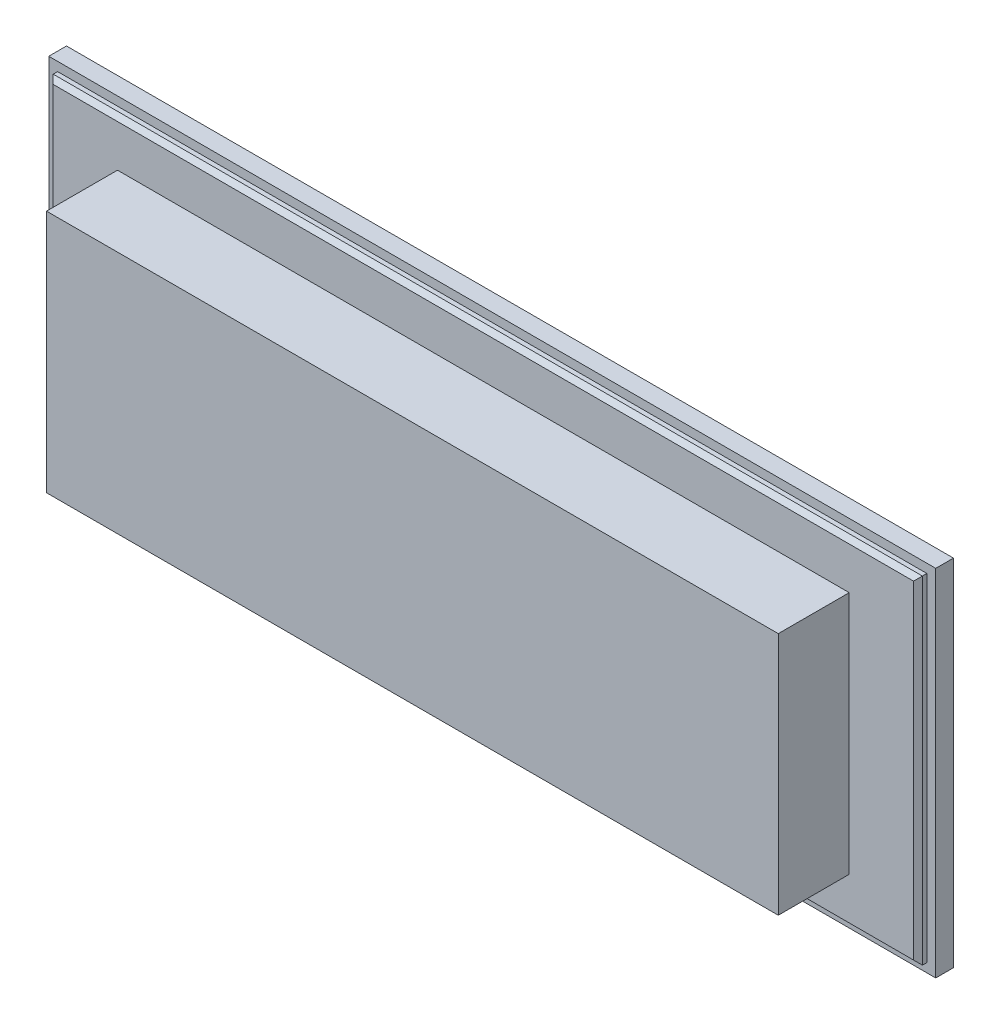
ISO-10303-21;
HEADER;
FILE_DESCRIPTION(('STEP AP214'),'2;1');
FILE_NAME('part.step','',(''),(''),'','','');
FILE_SCHEMA(('AUTOMOTIVE_DESIGN { 1 0 10303 214 1 1 1 1 }'));
ENDSEC;
DATA;
#1=APPLICATION_CONTEXT('core data for automotive mechanical design processes');
#2=APPLICATION_PROTOCOL_DEFINITION('international standard','automotive_design',2000,#1);
#3=PRODUCT_CONTEXT('',#1,'mechanical');
#4=PRODUCT('Part','Part','',(#3));
#5=PRODUCT_RELATED_PRODUCT_CATEGORY('part','',(#4));
#6=PRODUCT_DEFINITION_FORMATION('','',#4);
#7=PRODUCT_DEFINITION_CONTEXT('part definition',#1,'design');
#8=PRODUCT_DEFINITION('design','',#6,#7);
#9=PRODUCT_DEFINITION_SHAPE('','',#8);
#10=(LENGTH_UNIT() NAMED_UNIT(*) SI_UNIT(.MILLI.,.METRE.));
#11=(NAMED_UNIT(*) PLANE_ANGLE_UNIT() SI_UNIT($,.RADIAN.));
#12=(NAMED_UNIT(*) SI_UNIT($,.STERADIAN.) SOLID_ANGLE_UNIT());
#13=UNCERTAINTY_MEASURE_WITH_UNIT(LENGTH_MEASURE(1.E-05),#10,'distance_accuracy_value','');
#14=(GEOMETRIC_REPRESENTATION_CONTEXT(3) GLOBAL_UNCERTAINTY_ASSIGNED_CONTEXT((#13)) GLOBAL_UNIT_ASSIGNED_CONTEXT((#10,
#11,#12)) REPRESENTATION_CONTEXT('',''));
#15=CARTESIAN_POINT('',(0.,0.,0.));
#16=DIRECTION('',(0.,0.,1.));
#17=DIRECTION('',(1.,0.,0.));
#18=AXIS2_PLACEMENT_3D('',#15,#16,#17);
#19=CARTESIAN_POINT('',(0.,0.,6.));
#20=DIRECTION('',(0.,0.,-1.));
#21=DIRECTION('',(-1.,0.,0.));
#22=AXIS2_PLACEMENT_3D('',#19,#20,#21);
#23=PLANE('',#22);
#24=DIRECTION('',(0.,-1.,0.));
#25=VECTOR('',#24,1.);
#26=CARTESIAN_POINT('',(-97.,0.,6.));
#27=LINE('',#26,#25);
#28=CARTESIAN_POINT('',(-97.,37.,6.));
#29=VERTEX_POINT('',#28);
#30=CARTESIAN_POINT('',(-97.,-37.,6.));
#31=VERTEX_POINT('',#30);
#32=EDGE_CURVE('E226',#29,#31,#27,.T.);
#33=ORIENTED_EDGE('',*,*,#32,.T.);
#34=DIRECTION('',(1.,0.,0.));
#35=VECTOR('',#34,1.);
#36=CARTESIAN_POINT('',(0.,-37.,6.));
#37=LINE('',#36,#35);
#38=CARTESIAN_POINT('',(97.,-37.,6.));
#39=VERTEX_POINT('',#38);
#40=EDGE_CURVE('E228',#31,#39,#37,.T.);
#41=ORIENTED_EDGE('',*,*,#40,.T.);
#42=DIRECTION('',(0.,1.,0.));
#43=VECTOR('',#42,1.);
#44=CARTESIAN_POINT('',(97.,0.,6.));
#45=LINE('',#44,#43);
#46=CARTESIAN_POINT('',(97.,37.,6.));
#47=VERTEX_POINT('',#46);
#48=EDGE_CURVE('E222',#39,#47,#45,.T.);
#49=ORIENTED_EDGE('',*,*,#48,.T.);
#50=DIRECTION('',(-1.,0.,0.));
#51=VECTOR('',#50,1.);
#52=CARTESIAN_POINT('',(0.,37.,6.));
#53=LINE('',#52,#51);
#54=EDGE_CURVE('E224',#47,#29,#53,.T.);
#55=ORIENTED_EDGE('',*,*,#54,.T.);
#56=EDGE_LOOP('',(#33,#41,#49,#55));
#57=FACE_BOUND('',#56,.T.);
#58=DIRECTION('',(0.,1.,0.));
#59=VECTOR('',#58,1.);
#60=CARTESIAN_POINT('',(82.5,-27.5,6.));
#61=LINE('',#60,#59);
#62=CARTESIAN_POINT('',(82.5,-27.5,6.));
#63=VERTEX_POINT('',#62);
#64=CARTESIAN_POINT('',(82.5,27.5,6.));
#65=VERTEX_POINT('',#64);
#66=EDGE_CURVE('E59',#63,#65,#61,.T.);
#67=ORIENTED_EDGE('',*,*,#66,.F.);
#68=DIRECTION('',(1.,0.,0.));
#69=VECTOR('',#68,1.);
#70=CARTESIAN_POINT('',(-82.5,-27.5,6.));
#71=LINE('',#70,#69);
#72=CARTESIAN_POINT('',(-82.5,-27.5,6.));
#73=VERTEX_POINT('',#72);
#74=EDGE_CURVE('E63',#73,#63,#71,.T.);
#75=ORIENTED_EDGE('',*,*,#74,.F.);
#76=DIRECTION('',(0.,-1.,0.));
#77=VECTOR('',#76,1.);
#78=CARTESIAN_POINT('',(-82.5,-27.5,6.));
#79=LINE('',#78,#77);
#80=CARTESIAN_POINT('',(-82.5,27.5,6.));
#81=VERTEX_POINT('',#80);
#82=EDGE_CURVE('E515',#81,#73,#79,.T.);
#83=ORIENTED_EDGE('',*,*,#82,.F.);
#84=DIRECTION('',(-1.,0.,0.));
#85=VECTOR('',#84,1.);
#86=CARTESIAN_POINT('',(-82.5,27.5,6.));
#87=LINE('',#86,#85);
#88=EDGE_CURVE('E521',#65,#81,#87,.T.);
#89=ORIENTED_EDGE('',*,*,#88,.F.);
#90=EDGE_LOOP('',(#67,#75,#83,#89));
#91=FACE_BOUND('',#90,.T.);
#92=ADVANCED_FACE('F41',(#57,#91),#23,.F.);
#93=CARTESIAN_POINT('',(0.,0.,4.));
#94=DIRECTION('',(0.,0.,-1.));
#95=DIRECTION('',(-1.,0.,0.));
#96=AXIS2_PLACEMENT_3D('',#93,#94,#95);
#97=PLANE('',#96);
#98=DIRECTION('',(0.,1.,0.));
#99=VECTOR('',#98,1.);
#100=CARTESIAN_POINT('',(100.,-40.,4.));
#101=LINE('',#100,#99);
#102=CARTESIAN_POINT('',(100.,-40.,4.));
#103=VERTEX_POINT('',#102);
#104=CARTESIAN_POINT('',(100.,40.,4.));
#105=VERTEX_POINT('',#104);
#106=EDGE_CURVE('E193',#103,#105,#101,.T.);
#107=ORIENTED_EDGE('',*,*,#106,.T.);
#108=DIRECTION('',(-1.,0.,0.));
#109=VECTOR('',#108,1.);
#110=CARTESIAN_POINT('',(-100.,40.,4.));
#111=LINE('',#110,#109);
#112=CARTESIAN_POINT('',(-100.,40.,4.));
#113=VERTEX_POINT('',#112);
#114=EDGE_CURVE('E196',#105,#113,#111,.T.);
#115=ORIENTED_EDGE('',*,*,#114,.T.);
#116=DIRECTION('',(0.,-1.,0.));
#117=VECTOR('',#116,1.);
#118=CARTESIAN_POINT('',(-100.,-40.,4.));
#119=LINE('',#118,#117);
#120=CARTESIAN_POINT('',(-100.,-40.,4.));
#121=VERTEX_POINT('',#120);
#122=EDGE_CURVE('E199',#113,#121,#119,.T.);
#123=ORIENTED_EDGE('',*,*,#122,.T.);
#124=DIRECTION('',(1.,0.,0.));
#125=VECTOR('',#124,1.);
#126=CARTESIAN_POINT('',(-100.,-40.,4.));
#127=LINE('',#126,#125);
#128=EDGE_CURVE('E201',#121,#103,#127,.T.);
#129=ORIENTED_EDGE('',*,*,#128,.T.);
#130=EDGE_LOOP('',(#107,#115,#123,#129));
#131=FACE_BOUND('',#130,.T.);
#132=DIRECTION('',(0.,1.,0.));
#133=VECTOR('',#132,1.);
#134=CARTESIAN_POINT('',(98.,-38.,4.));
#135=LINE('',#134,#133);
#136=CARTESIAN_POINT('',(98.,-38.,4.));
#137=VERTEX_POINT('',#136);
#138=CARTESIAN_POINT('',(98.,38.,4.));
#139=VERTEX_POINT('',#138);
#140=EDGE_CURVE('E172',#137,#139,#135,.T.);
#141=ORIENTED_EDGE('',*,*,#140,.F.);
#142=DIRECTION('',(1.,0.,0.));
#143=VECTOR('',#142,1.);
#144=CARTESIAN_POINT('',(-98.,-38.,4.));
#145=LINE('',#144,#143);
#146=CARTESIAN_POINT('',(-98.,-38.,4.));
#147=VERTEX_POINT('',#146);
#148=EDGE_CURVE('E181',#147,#137,#145,.T.);
#149=ORIENTED_EDGE('',*,*,#148,.F.);
#150=DIRECTION('',(0.,-1.,0.));
#151=VECTOR('',#150,1.);
#152=CARTESIAN_POINT('',(-98.,-38.,4.));
#153=LINE('',#152,#151);
#154=CARTESIAN_POINT('',(-98.,38.,4.));
#155=VERTEX_POINT('',#154);
#156=EDGE_CURVE('E178',#155,#147,#153,.T.);
#157=ORIENTED_EDGE('',*,*,#156,.F.);
#158=DIRECTION('',(-1.,0.,0.));
#159=VECTOR('',#158,1.);
#160=CARTESIAN_POINT('',(-98.,38.,4.));
#161=LINE('',#160,#159);
#162=EDGE_CURVE('E175',#139,#155,#161,.T.);
#163=ORIENTED_EDGE('',*,*,#162,.F.);
#164=EDGE_LOOP('',(#141,#149,#157,#163));
#165=FACE_BOUND('',#164,.T.);
#166=ADVANCED_FACE('F264',(#131,#165),#97,.F.);
#167=CARTESIAN_POINT('',(100.,-40.,4.));
#168=DIRECTION('',(-1.,0.,0.));
#169=DIRECTION('',(0.,0.,1.));
#170=AXIS2_PLACEMENT_3D('',#167,#168,#169);
#171=PLANE('',#170);
#172=DIRECTION('',(0.,1.,0.));
#173=VECTOR('',#172,1.);
#174=CARTESIAN_POINT('',(100.,-40.,0.));
#175=LINE('',#174,#173);
#176=CARTESIAN_POINT('',(100.,-40.,0.));
#177=VERTEX_POINT('',#176);
#178=CARTESIAN_POINT('',(100.,40.,0.));
#179=VERTEX_POINT('',#178);
#180=EDGE_CURVE('E192',#177,#179,#175,.T.);
#181=ORIENTED_EDGE('',*,*,#180,.T.);
#182=DIRECTION('',(0.,0.,-1.));
#183=VECTOR('',#182,1.);
#184=CARTESIAN_POINT('',(100.,40.,4.));
#185=LINE('',#184,#183);
#186=EDGE_CURVE('E219',#105,#179,#185,.T.);
#187=ORIENTED_EDGE('',*,*,#186,.F.);
#188=ORIENTED_EDGE('',*,*,#106,.F.);
#189=DIRECTION('',(0.,0.,-1.));
#190=VECTOR('',#189,1.);
#191=CARTESIAN_POINT('',(100.,-40.,4.));
#192=LINE('',#191,#190);
#193=EDGE_CURVE('E203',#103,#177,#192,.T.);
#194=ORIENTED_EDGE('',*,*,#193,.T.);
#195=EDGE_LOOP('',(#181,#187,#188,#194));
#196=FACE_BOUND('',#195,.T.);
#197=ADVANCED_FACE('F288',(#196),#171,.F.);
#198=CARTESIAN_POINT('',(-100.,40.,4.));
#199=DIRECTION('',(0.,-1.,0.));
#200=DIRECTION('',(0.,0.,-1.));
#201=AXIS2_PLACEMENT_3D('',#198,#199,#200);
#202=PLANE('',#201);
#203=DIRECTION('',(-1.,0.,0.));
#204=VECTOR('',#203,1.);
#205=CARTESIAN_POINT('',(-100.,40.,0.));
#206=LINE('',#205,#204);
#207=CARTESIAN_POINT('',(-100.,40.,0.));
#208=VERTEX_POINT('',#207);
#209=EDGE_CURVE('E206',#179,#208,#206,.T.);
#210=ORIENTED_EDGE('',*,*,#209,.T.);
#211=DIRECTION('',(0.,0.,-1.));
#212=VECTOR('',#211,1.);
#213=CARTESIAN_POINT('',(-100.,40.,4.));
#214=LINE('',#213,#212);
#215=EDGE_CURVE('E216',#113,#208,#214,.T.);
#216=ORIENTED_EDGE('',*,*,#215,.F.);
#217=ORIENTED_EDGE('',*,*,#114,.F.);
#218=ORIENTED_EDGE('',*,*,#186,.T.);
#219=EDGE_LOOP('',(#210,#216,#217,#218));
#220=FACE_BOUND('',#219,.T.);
#221=ADVANCED_FACE('F416',(#220),#202,.F.);
#222=CARTESIAN_POINT('',(-100.,-40.,4.));
#223=DIRECTION('',(1.,0.,0.));
#224=DIRECTION('',(0.,0.,-1.));
#225=AXIS2_PLACEMENT_3D('',#222,#223,#224);
#226=PLANE('',#225);
#227=DIRECTION('',(0.,-1.,0.));
#228=VECTOR('',#227,1.);
#229=CARTESIAN_POINT('',(-100.,-40.,0.));
#230=LINE('',#229,#228);
#231=CARTESIAN_POINT('',(-100.,-40.,0.));
#232=VERTEX_POINT('',#231);
#233=EDGE_CURVE('E208',#208,#232,#230,.T.);
#234=ORIENTED_EDGE('',*,*,#233,.T.);
#235=DIRECTION('',(0.,0.,-1.));
#236=VECTOR('',#235,1.);
#237=CARTESIAN_POINT('',(-100.,-40.,4.));
#238=LINE('',#237,#236);
#239=EDGE_CURVE('E213',#121,#232,#238,.T.);
#240=ORIENTED_EDGE('',*,*,#239,.F.);
#241=ORIENTED_EDGE('',*,*,#122,.F.);
#242=ORIENTED_EDGE('',*,*,#215,.T.);
#243=EDGE_LOOP('',(#234,#240,#241,#242));
#244=FACE_BOUND('',#243,.T.);
#245=ADVANCED_FACE('F405',(#244),#226,.F.);
#246=CARTESIAN_POINT('',(-100.,-40.,4.));
#247=DIRECTION('',(0.,1.,0.));
#248=DIRECTION('',(0.,0.,1.));
#249=AXIS2_PLACEMENT_3D('',#246,#247,#248);
#250=PLANE('',#249);
#251=DIRECTION('',(1.,0.,0.));
#252=VECTOR('',#251,1.);
#253=CARTESIAN_POINT('',(-100.,-40.,0.));
#254=LINE('',#253,#252);
#255=EDGE_CURVE('E197',#232,#177,#254,.T.);
#256=ORIENTED_EDGE('',*,*,#255,.T.);
#257=ORIENTED_EDGE('',*,*,#193,.F.);
#258=ORIENTED_EDGE('',*,*,#128,.F.);
#259=ORIENTED_EDGE('',*,*,#239,.T.);
#260=EDGE_LOOP('',(#256,#257,#258,#259));
#261=FACE_BOUND('',#260,.T.);
#262=ADVANCED_FACE('F395',(#261),#250,.F.);
#263=CARTESIAN_POINT('',(0.,0.,0.));
#264=DIRECTION('',(0.,0.,-1.));
#265=DIRECTION('',(-1.,0.,0.));
#266=AXIS2_PLACEMENT_3D('',#263,#264,#265);
#267=PLANE('',#266);
#268=ORIENTED_EDGE('',*,*,#180,.F.);
#269=ORIENTED_EDGE('',*,*,#255,.F.);
#270=ORIENTED_EDGE('',*,*,#233,.F.);
#271=ORIENTED_EDGE('',*,*,#209,.F.);
#272=EDGE_LOOP('',(#268,#269,#270,#271));
#273=FACE_BOUND('',#272,.T.);
#274=ADVANCED_FACE('F377',(#273),#267,.T.);
#275=CARTESIAN_POINT('',(98.,-38.,6.));
#276=DIRECTION('',(-1.,0.,0.));
#277=DIRECTION('',(0.,0.,1.));
#278=AXIS2_PLACEMENT_3D('',#275,#276,#277);
#279=PLANE('',#278);
#280=DIRECTION('',(0.,0.,-1.));
#281=VECTOR('',#280,1.);
#282=CARTESIAN_POINT('',(98.,38.,6.));
#283=LINE('',#282,#281);
#284=CARTESIAN_POINT('',(98.,38.,5.));
#285=VERTEX_POINT('',#284);
#286=EDGE_CURVE('E190',#285,#139,#283,.T.);
#287=ORIENTED_EDGE('',*,*,#286,.F.);
#288=DIRECTION('',(0.,-1.,0.));
#289=VECTOR('',#288,1.);
#290=CARTESIAN_POINT('',(98.,-38.,5.));
#291=LINE('',#290,#289);
#292=CARTESIAN_POINT('',(98.,-38.,5.));
#293=VERTEX_POINT('',#292);
#294=EDGE_CURVE('E11',#285,#293,#291,.T.);
#295=ORIENTED_EDGE('',*,*,#294,.T.);
#296=DIRECTION('',(0.,0.,-1.));
#297=VECTOR('',#296,1.);
#298=CARTESIAN_POINT('',(98.,-38.,6.));
#299=LINE('',#298,#297);
#300=EDGE_CURVE('E184',#293,#137,#299,.T.);
#301=ORIENTED_EDGE('',*,*,#300,.T.);
#302=ORIENTED_EDGE('',*,*,#140,.T.);
#303=EDGE_LOOP('',(#287,#295,#301,#302));
#304=FACE_BOUND('',#303,.T.);
#305=ADVANCED_FACE('F259',(#304),#279,.F.);
#306=CARTESIAN_POINT('',(-98.,38.,6.));
#307=DIRECTION('',(0.,-1.,0.));
#308=DIRECTION('',(0.,0.,-1.));
#309=AXIS2_PLACEMENT_3D('',#306,#307,#308);
#310=PLANE('',#309);
#311=DIRECTION('',(0.,0.,-1.));
#312=VECTOR('',#311,1.);
#313=CARTESIAN_POINT('',(-98.,38.,6.));
#314=LINE('',#313,#312);
#315=CARTESIAN_POINT('',(-98.,38.,5.));
#316=VERTEX_POINT('',#315);
#317=EDGE_CURVE('E188',#316,#155,#314,.T.);
#318=ORIENTED_EDGE('',*,*,#317,.F.);
#319=DIRECTION('',(1.,0.,0.));
#320=VECTOR('',#319,1.);
#321=CARTESIAN_POINT('',(-98.,38.,5.));
#322=LINE('',#321,#320);
#323=EDGE_CURVE('E51',#316,#285,#322,.T.);
#324=ORIENTED_EDGE('',*,*,#323,.T.);
#325=ORIENTED_EDGE('',*,*,#286,.T.);
#326=ORIENTED_EDGE('',*,*,#162,.T.);
#327=EDGE_LOOP('',(#318,#324,#325,#326));
#328=FACE_BOUND('',#327,.T.);
#329=ADVANCED_FACE('F256',(#328),#310,.F.);
#330=CARTESIAN_POINT('',(-98.,-38.,6.));
#331=DIRECTION('',(1.,0.,0.));
#332=DIRECTION('',(0.,0.,-1.));
#333=AXIS2_PLACEMENT_3D('',#330,#331,#332);
#334=PLANE('',#333);
#335=DIRECTION('',(0.,0.,-1.));
#336=VECTOR('',#335,1.);
#337=CARTESIAN_POINT('',(-98.,-38.,6.));
#338=LINE('',#337,#336);
#339=CARTESIAN_POINT('',(-98.,-38.,5.));
#340=VERTEX_POINT('',#339);
#341=EDGE_CURVE('E186',#340,#147,#338,.T.);
#342=ORIENTED_EDGE('',*,*,#341,.F.);
#343=DIRECTION('',(0.,1.,0.));
#344=VECTOR('',#343,1.);
#345=CARTESIAN_POINT('',(-98.,-38.,5.));
#346=LINE('',#345,#344);
#347=EDGE_CURVE('E234',#340,#316,#346,.T.);
#348=ORIENTED_EDGE('',*,*,#347,.T.);
#349=ORIENTED_EDGE('',*,*,#317,.T.);
#350=ORIENTED_EDGE('',*,*,#156,.T.);
#351=EDGE_LOOP('',(#342,#348,#349,#350));
#352=FACE_BOUND('',#351,.T.);
#353=ADVANCED_FACE('F271',(#352),#334,.F.);
#354=CARTESIAN_POINT('',(-98.,-38.,6.));
#355=DIRECTION('',(0.,1.,0.));
#356=DIRECTION('',(0.,0.,1.));
#357=AXIS2_PLACEMENT_3D('',#354,#355,#356);
#358=PLANE('',#357);
#359=ORIENTED_EDGE('',*,*,#300,.F.);
#360=DIRECTION('',(-1.,0.,0.));
#361=VECTOR('',#360,1.);
#362=CARTESIAN_POINT('',(-98.,-38.,5.));
#363=LINE('',#362,#361);
#364=EDGE_CURVE('E231',#293,#340,#363,.T.);
#365=ORIENTED_EDGE('',*,*,#364,.T.);
#366=ORIENTED_EDGE('',*,*,#341,.T.);
#367=ORIENTED_EDGE('',*,*,#148,.T.);
#368=EDGE_LOOP('',(#359,#365,#366,#367));
#369=FACE_BOUND('',#368,.T.);
#370=ADVANCED_FACE('F267',(#369),#358,.F.);
#371=CARTESIAN_POINT('',(0.,37.,6.));
#372=DIRECTION('',(0.,-0.707106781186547,-0.707106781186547));
#373=DIRECTION('',(-1.,0.,0.));
#374=AXIS2_PLACEMENT_3D('',#371,#372,#373);
#375=PLANE('',#374);
#376=DIRECTION('',(-0.577350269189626,-0.577350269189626,0.577350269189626));
#377=VECTOR('',#376,1.);
#378=CARTESIAN_POINT('',(84.6666666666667,24.6666666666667,18.3333333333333));
#379=LINE('',#378,#377);
#380=EDGE_CURVE('E237',#285,#47,#379,.T.);
#381=ORIENTED_EDGE('',*,*,#380,.F.);
#382=ORIENTED_EDGE('',*,*,#323,.F.);
#383=DIRECTION('',(0.577350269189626,-0.577350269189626,0.577350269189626));
#384=VECTOR('',#383,1.);
#385=CARTESIAN_POINT('',(-64.6666666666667,4.66666666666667,38.3333333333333));
#386=LINE('',#385,#384);
#387=EDGE_CURVE('E46',#29,#316,#386,.F.);
#388=ORIENTED_EDGE('',*,*,#387,.F.);
#389=ORIENTED_EDGE('',*,*,#54,.F.);
#390=EDGE_LOOP('',(#381,#382,#388,#389));
#391=FACE_BOUND('',#390,.T.);
#392=ADVANCED_FACE('F44',(#391),#375,.F.);
#393=CARTESIAN_POINT('',(-97.,0.,6.));
#394=DIRECTION('',(0.707106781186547,0.,-0.707106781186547));
#395=DIRECTION('',(0.,-1.,0.));
#396=AXIS2_PLACEMENT_3D('',#393,#394,#395);
#397=PLANE('',#396);
#398=ORIENTED_EDGE('',*,*,#387,.T.);
#399=ORIENTED_EDGE('',*,*,#347,.F.);
#400=DIRECTION('',(0.577350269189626,0.577350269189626,0.577350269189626));
#401=VECTOR('',#400,1.);
#402=CARTESIAN_POINT('',(-84.6666666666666,-24.6666666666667,18.3333333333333));
#403=LINE('',#402,#401);
#404=EDGE_CURVE('E166',#31,#340,#403,.F.);
#405=ORIENTED_EDGE('',*,*,#404,.F.);
#406=ORIENTED_EDGE('',*,*,#32,.F.);
#407=EDGE_LOOP('',(#398,#399,#405,#406));
#408=FACE_BOUND('',#407,.T.);
#409=ADVANCED_FACE('F248',(#408),#397,.F.);
#410=CARTESIAN_POINT('',(97.,0.,6.));
#411=DIRECTION('',(-0.707106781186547,0.,-0.707106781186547));
#412=DIRECTION('',(0.,1.,0.));
#413=AXIS2_PLACEMENT_3D('',#410,#411,#412);
#414=PLANE('',#413);
#415=ORIENTED_EDGE('',*,*,#380,.T.);
#416=ORIENTED_EDGE('',*,*,#48,.F.);
#417=DIRECTION('',(0.577350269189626,-0.577350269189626,-0.577350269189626));
#418=VECTOR('',#417,1.);
#419=CARTESIAN_POINT('',(84.6666666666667,-24.6666666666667,18.3333333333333));
#420=LINE('',#419,#418);
#421=EDGE_CURVE('E164',#293,#39,#420,.F.);
#422=ORIENTED_EDGE('',*,*,#421,.F.);
#423=ORIENTED_EDGE('',*,*,#294,.F.);
#424=EDGE_LOOP('',(#415,#416,#422,#423));
#425=FACE_BOUND('',#424,.T.);
#426=ADVANCED_FACE('F334',(#425),#414,.F.);
#427=CARTESIAN_POINT('',(0.,-37.,6.));
#428=DIRECTION('',(0.,0.707106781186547,-0.707106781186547));
#429=DIRECTION('',(1.,0.,0.));
#430=AXIS2_PLACEMENT_3D('',#427,#428,#429);
#431=PLANE('',#430);
#432=ORIENTED_EDGE('',*,*,#404,.T.);
#433=ORIENTED_EDGE('',*,*,#364,.F.);
#434=ORIENTED_EDGE('',*,*,#421,.T.);
#435=ORIENTED_EDGE('',*,*,#40,.F.);
#436=EDGE_LOOP('',(#432,#433,#434,#435));
#437=FACE_BOUND('',#436,.T.);
#438=ADVANCED_FACE('F294',(#437),#431,.F.);
#439=CARTESIAN_POINT('',(82.5,-27.5,22.));
#440=DIRECTION('',(-1.,0.,0.));
#441=DIRECTION('',(0.,0.,1.));
#442=AXIS2_PLACEMENT_3D('',#439,#440,#441);
#443=PLANE('',#442);
#444=ORIENTED_EDGE('',*,*,#66,.T.);
#445=DIRECTION('',(0.,0.,-1.));
#446=VECTOR('',#445,1.);
#447=CARTESIAN_POINT('',(82.5,27.5,22.));
#448=LINE('',#447,#446);
#449=CARTESIAN_POINT('',(82.5,27.5,22.));
#450=VERTEX_POINT('',#449);
#451=EDGE_CURVE('E147',#450,#65,#448,.T.);
#452=ORIENTED_EDGE('',*,*,#451,.F.);
#453=DIRECTION('',(0.,1.,0.));
#454=VECTOR('',#453,1.);
#455=CARTESIAN_POINT('',(82.5,-27.5,22.));
#456=LINE('',#455,#454);
#457=CARTESIAN_POINT('',(82.5,-27.5,22.));
#458=VERTEX_POINT('',#457);
#459=EDGE_CURVE('E153',#458,#450,#456,.T.);
#460=ORIENTED_EDGE('',*,*,#459,.F.);
#461=DIRECTION('',(0.,0.,-1.));
#462=VECTOR('',#461,1.);
#463=CARTESIAN_POINT('',(82.5,-27.5,22.));
#464=LINE('',#463,#462);
#465=EDGE_CURVE('E513',#458,#63,#464,.T.);
#466=ORIENTED_EDGE('',*,*,#465,.T.);
#467=EDGE_LOOP('',(#444,#452,#460,#466));
#468=FACE_BOUND('',#467,.T.);
#469=ADVANCED_FACE('F163',(#468),#443,.F.);
#470=CARTESIAN_POINT('',(-82.5,27.5,22.));
#471=DIRECTION('',(0.,-1.,0.));
#472=DIRECTION('',(0.,0.,-1.));
#473=AXIS2_PLACEMENT_3D('',#470,#471,#472);
#474=PLANE('',#473);
#475=ORIENTED_EDGE('',*,*,#88,.T.);
#476=DIRECTION('',(0.,0.,-1.));
#477=VECTOR('',#476,1.);
#478=CARTESIAN_POINT('',(-82.5,27.5,22.));
#479=LINE('',#478,#477);
#480=CARTESIAN_POINT('',(-82.5,27.5,22.));
#481=VERTEX_POINT('',#480);
#482=EDGE_CURVE('E149',#481,#81,#479,.T.);
#483=ORIENTED_EDGE('',*,*,#482,.F.);
#484=DIRECTION('',(-1.,0.,0.));
#485=VECTOR('',#484,1.);
#486=CARTESIAN_POINT('',(-82.5,27.5,22.));
#487=LINE('',#486,#485);
#488=EDGE_CURVE('E142',#450,#481,#487,.T.);
#489=ORIENTED_EDGE('',*,*,#488,.F.);
#490=ORIENTED_EDGE('',*,*,#451,.T.);
#491=EDGE_LOOP('',(#475,#483,#489,#490));
#492=FACE_BOUND('',#491,.T.);
#493=ADVANCED_FACE('F145',(#492),#474,.F.);
#494=CARTESIAN_POINT('',(-82.5,-27.5,22.));
#495=DIRECTION('',(1.,0.,0.));
#496=DIRECTION('',(0.,0.,-1.));
#497=AXIS2_PLACEMENT_3D('',#494,#495,#496);
#498=PLANE('',#497);
#499=ORIENTED_EDGE('',*,*,#82,.T.);
#500=DIRECTION('',(0.,0.,-1.));
#501=VECTOR('',#500,1.);
#502=CARTESIAN_POINT('',(-82.5,-27.5,22.));
#503=LINE('',#502,#501);
#504=CARTESIAN_POINT('',(-82.5,-27.5,22.));
#505=VERTEX_POINT('',#504);
#506=EDGE_CURVE('E168',#505,#73,#503,.T.);
#507=ORIENTED_EDGE('',*,*,#506,.F.);
#508=DIRECTION('',(0.,-1.,0.));
#509=VECTOR('',#508,1.);
#510=CARTESIAN_POINT('',(-82.5,-27.5,22.));
#511=LINE('',#510,#509);
#512=EDGE_CURVE('E152',#481,#505,#511,.T.);
#513=ORIENTED_EDGE('',*,*,#512,.F.);
#514=ORIENTED_EDGE('',*,*,#482,.T.);
#515=EDGE_LOOP('',(#499,#507,#513,#514));
#516=FACE_BOUND('',#515,.T.);
#517=ADVANCED_FACE('F297',(#516),#498,.F.);
#518=CARTESIAN_POINT('',(-82.5,-27.5,22.));
#519=DIRECTION('',(0.,1.,0.));
#520=DIRECTION('',(0.,0.,1.));
#521=AXIS2_PLACEMENT_3D('',#518,#519,#520);
#522=PLANE('',#521);
#523=ORIENTED_EDGE('',*,*,#74,.T.);
#524=ORIENTED_EDGE('',*,*,#465,.F.);
#525=DIRECTION('',(1.,0.,0.));
#526=VECTOR('',#525,1.);
#527=CARTESIAN_POINT('',(-82.5,-27.5,22.));
#528=LINE('',#527,#526);
#529=EDGE_CURVE('E158',#505,#458,#528,.T.);
#530=ORIENTED_EDGE('',*,*,#529,.F.);
#531=ORIENTED_EDGE('',*,*,#506,.T.);
#532=EDGE_LOOP('',(#523,#524,#530,#531));
#533=FACE_BOUND('',#532,.T.);
#534=ADVANCED_FACE('F300',(#533),#522,.F.);
#535=CARTESIAN_POINT('',(0.,0.,22.));
#536=DIRECTION('',(0.,0.,-1.));
#537=DIRECTION('',(-1.,0.,0.));
#538=AXIS2_PLACEMENT_3D('',#535,#536,#537);
#539=PLANE('',#538);
#540=ORIENTED_EDGE('',*,*,#459,.T.);
#541=ORIENTED_EDGE('',*,*,#488,.T.);
#542=ORIENTED_EDGE('',*,*,#512,.T.);
#543=ORIENTED_EDGE('',*,*,#529,.T.);
#544=EDGE_LOOP('',(#540,#541,#542,#543));
#545=FACE_BOUND('',#544,.T.);
#546=ADVANCED_FACE('F156',(#545),#539,.F.);
#547=CLOSED_SHELL('',(#92,#166,#197,#221,#245,#262,#274,#305,#329,#353,#370,#392,#409,#426,#438,
#469,#493,#517,#534,#546));
#548=MANIFOLD_SOLID_BREP('B2',#547);
#549=ADVANCED_BREP_SHAPE_REPRESENTATION('',(#18,#548),#14);
#550=SHAPE_DEFINITION_REPRESENTATION(#9,#549);
ENDSEC;
END-ISO-10303-21;
